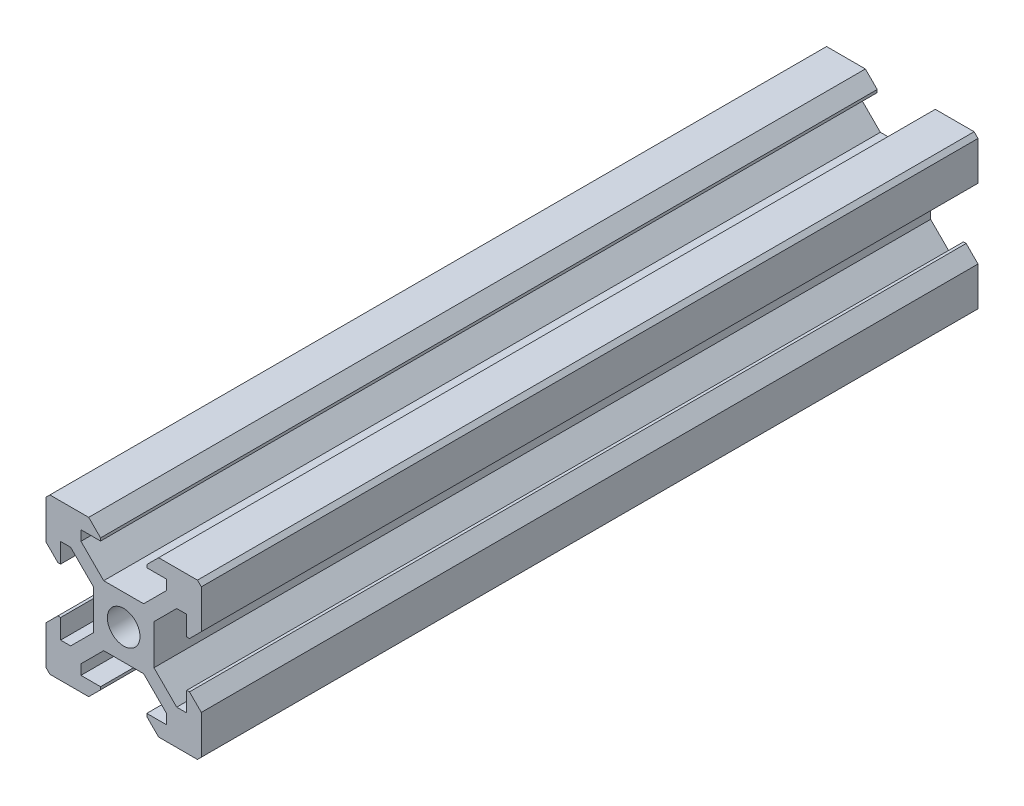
from build123d import *

# Parameters (mm, degrees)
BOSS_EXTRUDE1_DEPTH = 100
CHAMFER2_SIZE       = 0.5
CHAMFER2_SIZE2      = 0.353553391
CHAMFER1_SIZE       = 0.5


with BuildPart() as part:
    # Sketch1 → Boss-Extrude1 (new body)
    with BuildSketch(Plane.XY):
        with BuildLine():
            Line((5.5, 6.829360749), (2.570639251, 3.9))
            Line((2.570639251, 3.9), (0, 3.9))
            Line((0, 3.9), (0, 2.1))
            ThreePointArc((0, 2.1), (0.803635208, 1.940147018), (1.48492424, 1.48492424))
            Line((1.48492424, 1.48492424), (10, 10))
            Line((10, 10), (4.5, 10))
            Line((4.5, 10), (2.62, 8.12))
            Line((2.62, 8.12), (5.5, 8.12))
            Line((5.5, 8.12), (5.5, 6.829360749))
        make_face()
    extrude(amount=BOSS_EXTRUDE1_DEPTH)

    # Chamfer2
    chamfer2_edges = [part.edges().sort_by_distance(p)[0] for p in [
        (2.62, 8.12, 50),
    ]]
    chamfer2_side = [part.faces().sort_by_distance(p)[0] for p in [
        (3.56, 9.06, 50),
    ]]
    chamfer(chamfer2_edges, length=CHAMFER2_SIZE, length2=CHAMFER2_SIZE2, reference=chamfer2_side[0])

    # Mirror1: part across plane


with BuildPart() as part_1:
    add(part.part)
    add(part.part.mirror(Plane(origin=(10, 10, 100), x_dir=(0, 0, 1), z_dir=(-0.7071067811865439, 0.7071067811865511, 0))))

    # Chamfer1
    chamfer1_edges = [part_1.edges().sort_by_distance(p)[0] for p in [
        (10, 10, 50),
    ]]
    chamfer(chamfer1_edges, length=CHAMFER1_SIZE)

    # Mirror4: part across plane


with BuildPart() as part_2:
    add(part_1.part)
    add(part_1.part.mirror(Plane(origin=(0, 3.9, 100), x_dir=(0, 0, 1), z_dir=(1, 0, 0))))

    # Mirror5: part across plane


with BuildPart() as part_3:
    add(part_2.part)
    add(part_2.part.mirror(Plane(origin=(-3.9, 0, 100), x_dir=(0, 0, 1), z_dir=(0, 1, 0))))


solid = part_3.part
